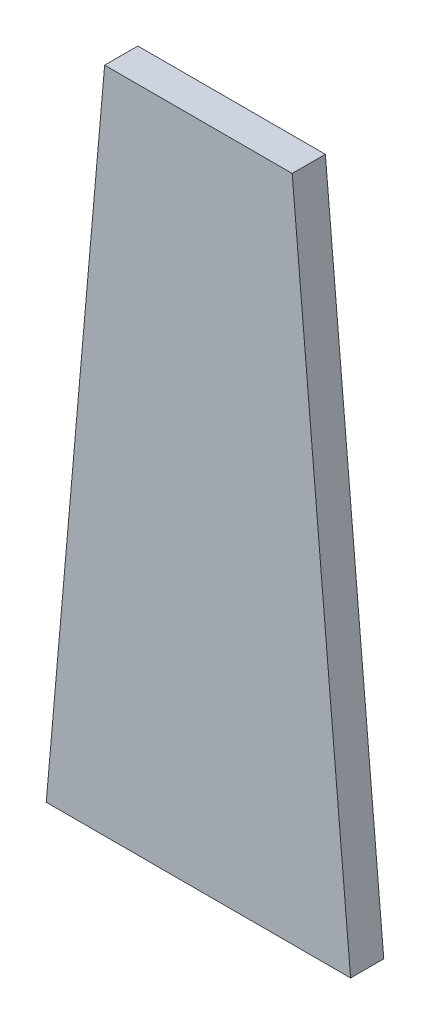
from build123d import *

# Parameters (mm, degrees)
BOSS_EXTRUDE1_DEPTH = 2


with BuildPart() as part:
    # Sketch1 → Boss-Extrude1 (new body)
    with BuildSketch(Plane.XY):
        Polygon((-5.653156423, 20.121840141), (5.653156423, 20.121840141), (9.174013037, -20.121840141), (-9.174013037, -20.121840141), align=None)
    extrude(amount=BOSS_EXTRUDE1_DEPTH)


solid = part.part
